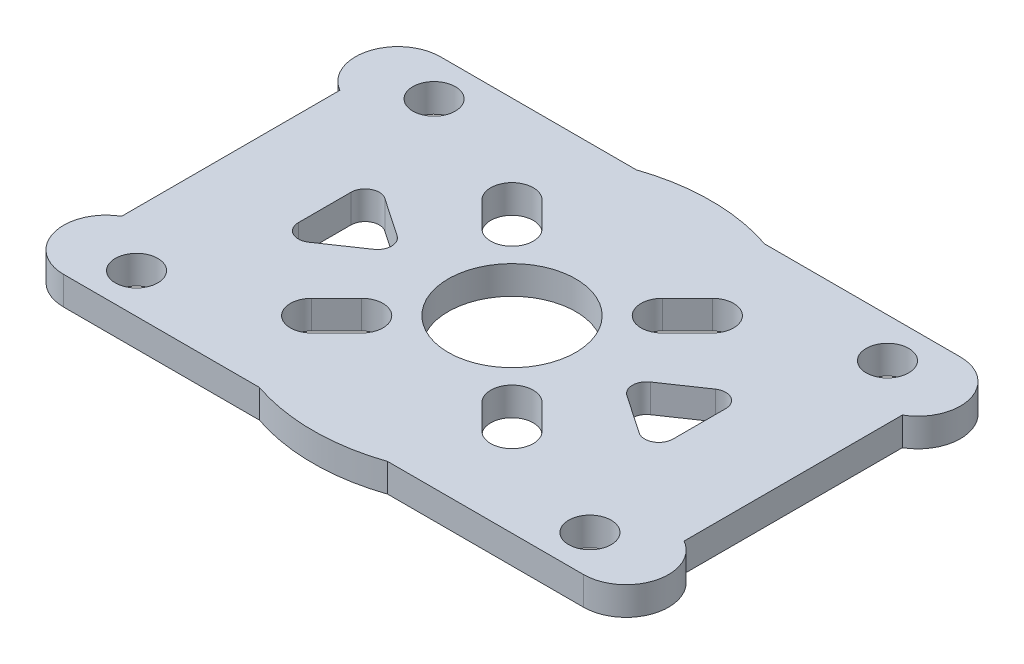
from build123d import *

# Parameters (mm, degrees)
SKETCH1_R           = 1.5
SKETCH1_R_2         = 4.5
BOSS_EXTRUDE1_DEPTH = 2


with BuildPart() as part:
    # Sketch1 → Boss-Extrude1 (new body)
    with BuildSketch(Plane(origin=(0, 0, 0), x_dir=(1, 0, 0), z_dir=(0, 1, 0))):
        with BuildLine():
            Line((-18.35, -13.3), (-4.529072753, -13.3))
            ThreePointArc((-4.529072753, -13.3), (0, -14.05), (4.529072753, -13.3))
            Line((4.529072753, -13.3), (18.35, -13.3))
            ThreePointArc((18.35, -13.3), (21.247777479, -11.076457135), (19.85, -7.701923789))
            Line((19.85, -7.701923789), (19.85, 7.701923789))
            ThreePointArc((19.85, 7.701923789), (21.247777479, 11.076457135), (18.35, 13.3))
            Line((18.35, 13.3), (4.529072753, 13.3))
            ThreePointArc((4.529072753, 13.3), (0, 14.05), (-4.529072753, 13.3))
            Line((-4.529072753, 13.3), (-18.35, 13.3))
            ThreePointArc((-18.35, 13.3), (-21.247777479, 11.076457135), (-19.85, 7.701923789))
            Line((-19.85, 7.701923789), (-19.85, -7.701923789))
            ThreePointArc((-19.85, -7.701923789), (-21.247777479, -11.076457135), (-18.35, -13.3))
        make_face()
        with Locations(Location((-16, 10.5, 0), (0, 0, 270))):
            Circle(SKETCH1_R, mode=Mode.SUBTRACT)
        with Locations(Location((-16, -10.5, 0), (0, 0, 270))):
            Circle(SKETCH1_R, mode=Mode.SUBTRACT)
        with Locations(Location((16, -10.5, 0), (0, 0, 270))):
            Circle(SKETCH1_R, mode=Mode.SUBTRACT)
        with Locations(Location((16, 10.5, 0), (0, 0, 270))):
            Circle(SKETCH1_R, mode=Mode.SUBTRACT)
        with Locations(Location((0, 0, 0), (0, 0, 270))):
            Circle(SKETCH1_R_2, mode=Mode.SUBTRACT)
        with BuildLine():
            Line((-6.01040764, 8.131727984), (-4.242640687, 6.363961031))
            ThreePointArc((-4.242640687, 6.363961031), (-4.242640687, 4.242640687), (-6.363961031, 4.242640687))
            Line((-6.363961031, 4.242640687), (-8.131727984, 6.01040764))
            ThreePointArc((-8.131727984, 6.01040764), (-8.131727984, 8.131727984), (-6.01040764, 8.131727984))
        make_face(mode=Mode.SUBTRACT)
        with BuildLine():
            Line((8.131727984, 6.01040764), (6.363961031, 4.242640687))
            ThreePointArc((6.363961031, 4.242640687), (4.242640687, 4.242640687), (4.242640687, 6.363961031))
            Line((4.242640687, 6.363961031), (6.01040764, 8.131727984))
            ThreePointArc((6.01040764, 8.131727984), (8.131727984, 8.131727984), (8.131727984, 6.01040764))
        make_face(mode=Mode.SUBTRACT)
        with BuildLine():
            Line((6.01040764, -8.131727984), (4.242640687, -6.363961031))
            ThreePointArc((4.242640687, -6.363961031), (4.242640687, -4.242640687), (6.363961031, -4.242640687))
            Line((6.363961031, -4.242640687), (8.131727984, -6.01040764))
            ThreePointArc((8.131727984, -6.01040764), (8.131727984, -8.131727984), (6.01040764, -8.131727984))
        make_face(mode=Mode.SUBTRACT)
        with BuildLine():
            Line((-8.131727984, -6.01040764), (-6.363961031, -4.242640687))
            ThreePointArc((-6.363961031, -4.242640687), (-4.242640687, -4.242640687), (-4.242640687, -6.363961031))
            Line((-4.242640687, -6.363961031), (-6.01040764, -8.131727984))
            ThreePointArc((-6.01040764, -8.131727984), (-8.131727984, -8.131727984), (-8.131727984, -6.01040764))
        make_face(mode=Mode.SUBTRACT)
        with BuildLine():
            Line((-13.224863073, 1.857861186), (-13.224863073, -1.857861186))
            ThreePointArc((-13.224863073, -1.857861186), (-12.69212273, -2.74198132), (-11.661526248, -2.684088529))
            Line((-11.661526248, -2.684088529), (-8.936663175, -0.826227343))
            ThreePointArc((-8.936663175, -0.826227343), (-8.5, 0), (-8.936663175, 0.826227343))
            Line((-8.936663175, 0.826227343), (-11.661526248, 2.684088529))
            ThreePointArc((-11.661526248, 2.684088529), (-12.69212273, 2.74198132), (-13.224863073, 1.857861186))
        make_face(mode=Mode.SUBTRACT)
        with BuildLine():
            Line((11.661526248, -2.684088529), (8.936663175, -0.826227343))
            ThreePointArc((8.936663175, -0.826227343), (8.5, 0), (8.936663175, 0.826227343))
            Line((8.936663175, 0.826227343), (11.661526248, 2.684088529))
            ThreePointArc((11.661526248, 2.684088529), (12.69212273, 2.74198132), (13.224863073, 1.857861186))
            Line((13.224863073, 1.857861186), (13.224863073, -1.857861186))
            ThreePointArc((13.224863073, -1.857861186), (12.69212273, -2.74198132), (11.661526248, -2.684088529))
        make_face(mode=Mode.SUBTRACT)
    extrude(amount=BOSS_EXTRUDE1_DEPTH)


solid = part.part
